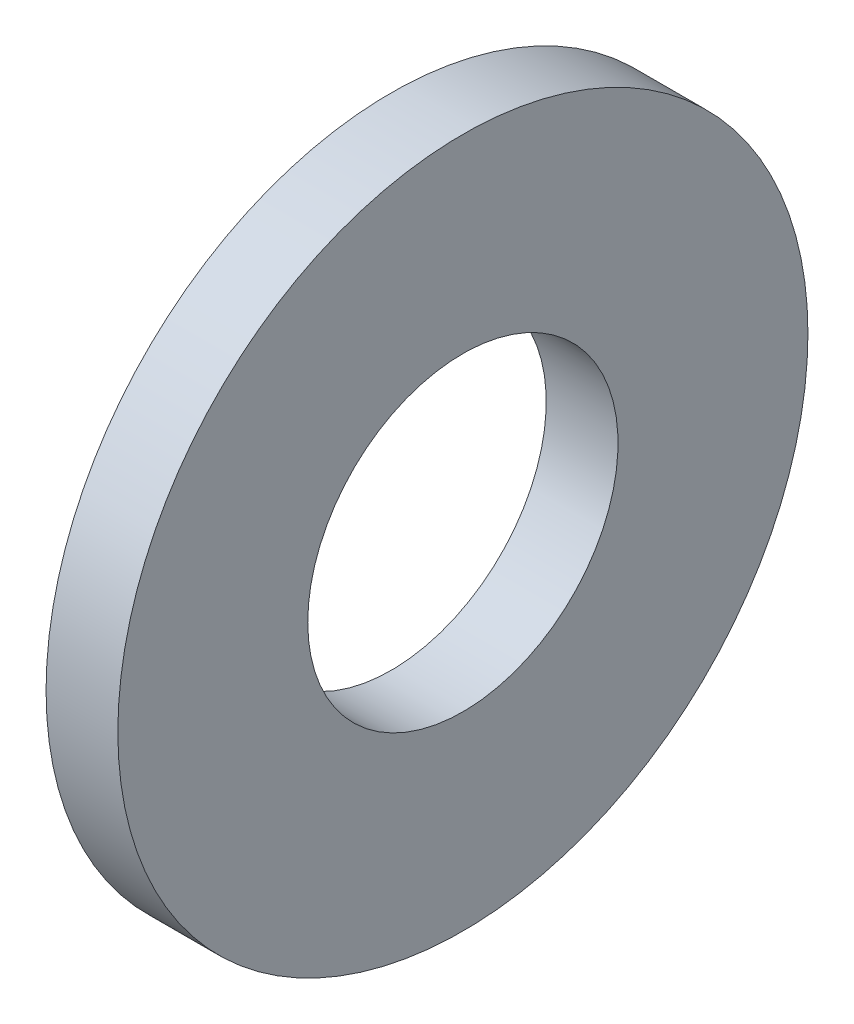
from build123d import *

# Parameters (mm, degrees)
SKETCH1_W = 1.651
SKETCH1_H = 4.3688


with BuildPart() as part:
    # Sketch1 → Base-Revolve (revolve)
    with BuildSketch(Plane.XY, mode=Mode.PRIVATE) as base_revolve_sk:
        with Locations((-0.8255, 5.7531)):
            Rectangle(SKETCH1_W, SKETCH1_H)
    revolve(base_revolve_sk.sketch.rotate(Axis((-34.925, 0, 0), (1, 0, 0)), 90), axis=Axis((-34.925, 0, 0), (1, 0, 0)))


solid = part.part
